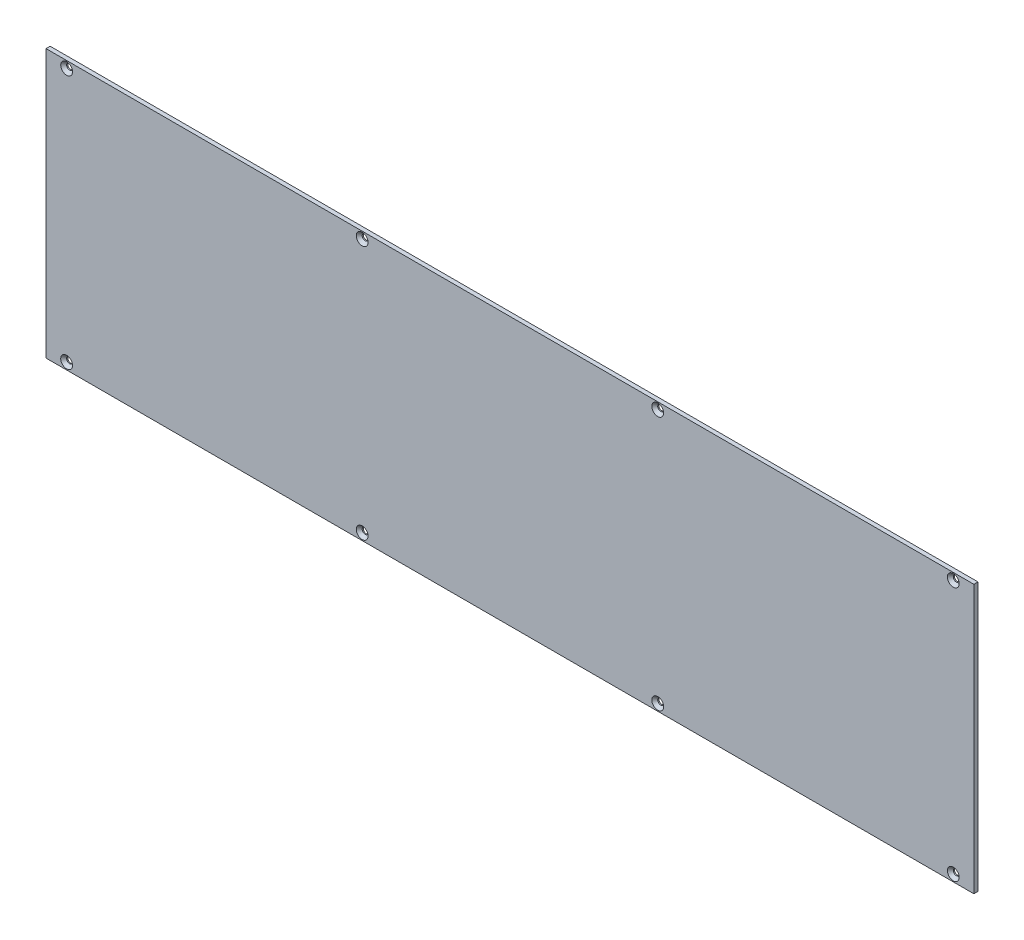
from build123d import *

# Parameters (mm, degrees)
SKETCH_1_W               = 675
SKETCH_1_H               = 195
EXTRUDE_1_DEPTH          = 3
SKETCH_2_R               = 4.3
CUT_EXTRUDE_1_DEPTH      = 2.15
DRAFT_1_ANGLE            = 45
SKETCH_3_R               = 2.15
CUT_EXTRUDE_2_DEPTH      = 703.605595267
SKETCH_4_R               = 2.15
CUT_EXTRUDE_3_DEPTH      = 703.605595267
SKETCH_6_R               = 2.15
CUT_EXTRUDE_4_DEPTH      = 703.605595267
SKETCH_7_R               = 2.15
CUT_EXTRUDE_5_DEPTH      = 703.605595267
SKETCH_8_R               = 2.15
CUT_EXTRUDE_6_DEPTH      = 703.605595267
SKETCH_9_R               = 2.15
CUT_EXTRUDE_7_DEPTH      = 703.605595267
SKETCH_10_R              = 2.15
CUT_EXTRUDE_8_DEPTH      = 703.605595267
CUT_EXTRUDE_9_DEPTH      = 703.605595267
CUT_EXTRUDE_9_DEPTH_BACK = 703.605595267
SKETCH_11_R              = 2.15


with BuildPart() as part:
    # Sketch 1 → Extrude 1 (new body)
    with BuildSketch(Plane.XY):
        with Locations((337.5, 97.5)):
            Rectangle(SKETCH_1_W, SKETCH_1_H)
    extrude(amount=EXTRUDE_1_DEPTH)

    # Sketch 2 → Cut-Extrude 1 (cut)
    with BuildSketch(Plane.XY.offset(3)):
        with Locations((15, 190)):
            Circle(SKETCH_2_R)
        with Locations((230, 190)):
            Circle(SKETCH_2_R)
        with Locations((445, 190)):
            Circle(SKETCH_2_R)
        with Locations((660, 190)):
            Circle(SKETCH_2_R)
        with Locations((15, 5)):
            Circle(SKETCH_2_R)
        with Locations((230, 5)):
            Circle(SKETCH_2_R)
        with Locations((445, 5)):
            Circle(SKETCH_2_R)
        with Locations((660, 5)):
            Circle(SKETCH_2_R)
    extrude(amount=-CUT_EXTRUDE_1_DEPTH, mode=Mode.SUBTRACT)

    # Draft 1
    draft_1_faces = [part.faces().sort_by_distance(p)[0] for p in [
        (10.7, 5, 1.925),
        (225.7, 5, 1.925),
        (440.7, 5, 1.925),
        (655.7, 5, 1.925),
        (655.7, 190, 1.925),
        (440.7, 190, 1.925),
        (225.7, 190, 1.925),
        (10.7, 190, 1.925),
    ]]
    draft(draft_1_faces, Plane.XY.offset(3), DRAFT_1_ANGLE)

    # Sketch 3 → Cut-Extrude 2 (cut, through all)
    with BuildSketch(Plane.XY.offset(0.85)):
        with Locations((15, 190)):
            Circle(SKETCH_3_R)
    extrude(amount=-CUT_EXTRUDE_2_DEPTH, mode=Mode.SUBTRACT)

    # Sketch 4 → Cut-Extrude 3 (cut, through all)
    with BuildSketch(Plane.XY.offset(0.85)):
        with Locations((230, 190)):
            Circle(SKETCH_4_R)
    extrude(amount=-CUT_EXTRUDE_3_DEPTH, mode=Mode.SUBTRACT)

    # Sketch 6 → Cut-Extrude 4 (cut, through all)
    with BuildSketch(Plane.XY.offset(0.85)):
        with Locations((445, 190)):
            Circle(SKETCH_6_R)
    extrude(amount=-CUT_EXTRUDE_4_DEPTH, mode=Mode.SUBTRACT)

    # Sketch 7 → Cut-Extrude 5 (cut, through all)
    with BuildSketch(Plane.XY.offset(0.85)):
        with Locations((660, 190)):
            Circle(SKETCH_7_R)
    extrude(amount=-CUT_EXTRUDE_5_DEPTH, mode=Mode.SUBTRACT)

    # Sketch 8 → Cut-Extrude 6 (cut, through all)
    with BuildSketch(Plane.XY.offset(0.85)):
        with Locations((660, 5)):
            Circle(SKETCH_8_R)
    extrude(amount=-CUT_EXTRUDE_6_DEPTH, mode=Mode.SUBTRACT)

    # Sketch 9 → Cut-Extrude 7 (cut, through all)
    with BuildSketch(Plane.XY.offset(0.85)):
        with Locations((445, 5)):
            Circle(SKETCH_9_R)
    extrude(amount=-CUT_EXTRUDE_7_DEPTH, mode=Mode.SUBTRACT)

    # Sketch 10 → Cut-Extrude 8 (cut, through all)
    with BuildSketch(Plane.XY.offset(0.85)):
        with Locations((230, 5)):
            Circle(SKETCH_10_R)
    extrude(amount=-CUT_EXTRUDE_8_DEPTH, mode=Mode.SUBTRACT)

    # Sketch 11 → Cut-Extrude 9 (cut, two sides: drawn at the far end of the back side and taken through both)
    with BuildSketch(Plane.XY.offset(0.85).offset(-CUT_EXTRUDE_9_DEPTH_BACK)):
        with Locations((15, 5)):
            Circle(SKETCH_11_R)
    extrude(amount=CUT_EXTRUDE_9_DEPTH + CUT_EXTRUDE_9_DEPTH_BACK, mode=Mode.SUBTRACT)


solid = part.part
